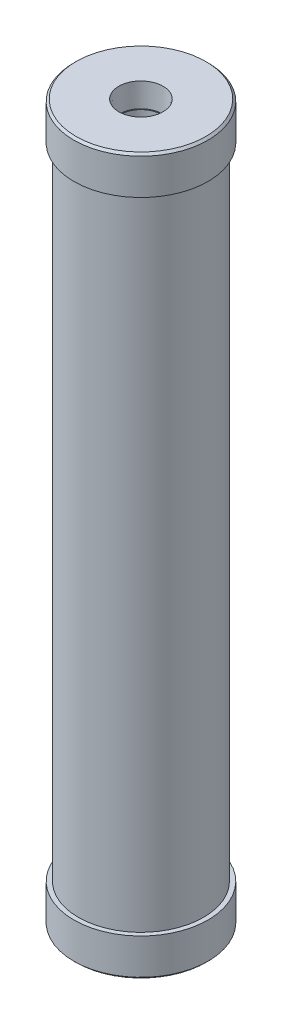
ISO-10303-21;
HEADER;
FILE_DESCRIPTION(('STEP AP214'),'2;1');
FILE_NAME('part.step','',(''),(''),'','','');
FILE_SCHEMA(('AUTOMOTIVE_DESIGN { 1 0 10303 214 1 1 1 1 }'));
ENDSEC;
DATA;
#1=APPLICATION_CONTEXT('core data for automotive mechanical design processes');
#2=APPLICATION_PROTOCOL_DEFINITION('international standard','automotive_design',2000,#1);
#3=PRODUCT_CONTEXT('',#1,'mechanical');
#4=PRODUCT('Part','Part','',(#3));
#5=PRODUCT_RELATED_PRODUCT_CATEGORY('part','',(#4));
#6=PRODUCT_DEFINITION_FORMATION('','',#4);
#7=PRODUCT_DEFINITION_CONTEXT('part definition',#1,'design');
#8=PRODUCT_DEFINITION('design','',#6,#7);
#9=PRODUCT_DEFINITION_SHAPE('','',#8);
#10=(LENGTH_UNIT() NAMED_UNIT(*) SI_UNIT(.MILLI.,.METRE.));
#11=(NAMED_UNIT(*) PLANE_ANGLE_UNIT() SI_UNIT($,.RADIAN.));
#12=(NAMED_UNIT(*) SI_UNIT($,.STERADIAN.) SOLID_ANGLE_UNIT());
#13=UNCERTAINTY_MEASURE_WITH_UNIT(LENGTH_MEASURE(1.E-05),#10,'distance_accuracy_value','');
#14=(GEOMETRIC_REPRESENTATION_CONTEXT(3) GLOBAL_UNCERTAINTY_ASSIGNED_CONTEXT((#13)) GLOBAL_UNIT_ASSIGNED_CONTEXT((#10,
#11,#12)) REPRESENTATION_CONTEXT('',''));
#15=CARTESIAN_POINT('',(0.,0.,0.));
#16=DIRECTION('',(0.,0.,1.));
#17=DIRECTION('',(1.,0.,0.));
#18=AXIS2_PLACEMENT_3D('',#15,#16,#17);
#19=CARTESIAN_POINT('',(0.,508.,0.));
#20=DIRECTION('',(0.,-1.,0.));
#21=DIRECTION('',(0.,0.,-1.));
#22=AXIS2_PLACEMENT_3D('',#19,#20,#21);
#23=CYLINDRICAL_SURFACE('',#22,44.45);
#24=CARTESIAN_POINT('',(0.,26.924,0.));
#25=DIRECTION('',(0.,1.,0.));
#26=DIRECTION('',(0.,0.,1.));
#27=AXIS2_PLACEMENT_3D('',#24,#25,#26);
#28=CIRCLE('',#27,44.45);
#29=CARTESIAN_POINT('',(0.,26.924,44.45));
#30=VERTEX_POINT('',#29);
#31=EDGE_CURVE('E71',#30,#30,#28,.T.);
#32=ORIENTED_EDGE('',*,*,#31,.T.);
#33=EDGE_LOOP('',(#32));
#34=FACE_BOUND('',#33,.T.);
#35=CARTESIAN_POINT('',(0.,481.076,0.));
#36=DIRECTION('',(0.,1.,0.));
#37=DIRECTION('',(0.,0.,1.));
#38=AXIS2_PLACEMENT_3D('',#35,#36,#37);
#39=CIRCLE('',#38,44.45);
#40=CARTESIAN_POINT('',(0.,481.076,44.45));
#41=VERTEX_POINT('',#40);
#42=EDGE_CURVE('E53',#41,#41,#39,.T.);
#43=ORIENTED_EDGE('',*,*,#42,.F.);
#44=EDGE_LOOP('',(#43));
#45=FACE_BOUND('',#44,.T.);
#46=ADVANCED_FACE('F33',(#34,#45),#23,.T.);
#47=CARTESIAN_POINT('',(0.,508.,0.));
#48=DIRECTION('',(0.,-1.,0.));
#49=DIRECTION('',(0.,0.,-1.));
#50=AXIS2_PLACEMENT_3D('',#47,#48,#49);
#51=CYLINDRICAL_SURFACE('',#50,38.6334);
#52=CARTESIAN_POINT('',(0.,26.924,0.));
#53=DIRECTION('',(0.,1.,0.));
#54=DIRECTION('',(0.,0.,1.));
#55=AXIS2_PLACEMENT_3D('',#52,#53,#54);
#56=CIRCLE('',#55,38.6334);
#57=CARTESIAN_POINT('',(0.,26.924,38.6334));
#58=VERTEX_POINT('',#57);
#59=EDGE_CURVE('E68',#58,#58,#56,.T.);
#60=ORIENTED_EDGE('',*,*,#59,.F.);
#61=EDGE_LOOP('',(#60));
#62=FACE_BOUND('',#61,.T.);
#63=CARTESIAN_POINT('',(0.,481.076,0.));
#64=DIRECTION('',(0.,1.,0.));
#65=DIRECTION('',(0.,0.,1.));
#66=AXIS2_PLACEMENT_3D('',#63,#64,#65);
#67=CIRCLE('',#66,38.6334);
#68=CARTESIAN_POINT('',(0.,481.076,38.6334));
#69=VERTEX_POINT('',#68);
#70=EDGE_CURVE('E59',#69,#69,#67,.T.);
#71=ORIENTED_EDGE('',*,*,#70,.T.);
#72=EDGE_LOOP('',(#71));
#73=FACE_BOUND('',#72,.T.);
#74=ADVANCED_FACE('F115',(#62,#73),#51,.F.);
#75=CARTESIAN_POINT('',(0.,26.924,0.));
#76=DIRECTION('',(0.,1.,0.));
#77=DIRECTION('',(0.,0.,1.));
#78=AXIS2_PLACEMENT_3D('',#75,#76,#77);
#79=PLANE('',#78);
#80=CARTESIAN_POINT('',(0.,26.924,0.));
#81=DIRECTION('',(0.,1.,0.));
#82=DIRECTION('',(0.,0.,1.));
#83=AXIS2_PLACEMENT_3D('',#80,#81,#82);
#84=CIRCLE('',#83,14.4907);
#85=CARTESIAN_POINT('',(0.,26.924,14.4907));
#86=VERTEX_POINT('',#85);
#87=EDGE_CURVE('E63',#86,#86,#84,.T.);
#88=ORIENTED_EDGE('',*,*,#87,.F.);
#89=EDGE_LOOP('',(#88));
#90=FACE_BOUND('',#89,.T.);
#91=ORIENTED_EDGE('',*,*,#59,.T.);
#92=EDGE_LOOP('',(#91));
#93=FACE_BOUND('',#92,.T.);
#94=ADVANCED_FACE('F121',(#90,#93),#79,.T.);
#95=CARTESIAN_POINT('',(0.,26.924,0.));
#96=DIRECTION('',(0.,1.,0.));
#97=DIRECTION('',(0.,0.,1.));
#98=AXIS2_PLACEMENT_3D('',#95,#96,#97);
#99=CIRCLE('',#98,47.625);
#100=CARTESIAN_POINT('',(0.,26.924,47.625));
#101=VERTEX_POINT('',#100);
#102=EDGE_CURVE('E66',#101,#101,#99,.T.);
#103=ORIENTED_EDGE('',*,*,#102,.T.);
#104=EDGE_LOOP('',(#103));
#105=FACE_BOUND('',#104,.T.);
#106=ORIENTED_EDGE('',*,*,#31,.F.);
#107=EDGE_LOOP('',(#106));
#108=FACE_BOUND('',#107,.T.);
#109=ADVANCED_FACE('F142',(#105,#108),#79,.T.);
#110=CARTESIAN_POINT('',(0.,26.924,0.));
#111=DIRECTION('',(0.,-1.,0.));
#112=DIRECTION('',(0.,0.,-1.));
#113=AXIS2_PLACEMENT_3D('',#110,#111,#112);
#114=CYLINDRICAL_SURFACE('',#113,47.625);
#115=CARTESIAN_POINT('',(0.,1.52400000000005,0.));
#116=DIRECTION('',(0.,1.,0.));
#117=DIRECTION('',(0.,0.,1.));
#118=AXIS2_PLACEMENT_3D('',#115,#116,#117);
#119=CIRCLE('',#118,47.625);
#120=CARTESIAN_POINT('',(0.,1.52400000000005,47.625));
#121=VERTEX_POINT('',#120);
#122=EDGE_CURVE('E48',#121,#121,#119,.T.);
#123=ORIENTED_EDGE('',*,*,#122,.T.);
#124=EDGE_LOOP('',(#123));
#125=FACE_BOUND('',#124,.T.);
#126=ORIENTED_EDGE('',*,*,#102,.F.);
#127=EDGE_LOOP('',(#126));
#128=FACE_BOUND('',#127,.T.);
#129=ADVANCED_FACE('F139',(#125,#128),#114,.T.);
#130=CARTESIAN_POINT('',(0.,0.,0.));
#131=DIRECTION('',(0.,1.,0.));
#132=DIRECTION('',(0.,0.,1.));
#133=AXIS2_PLACEMENT_3D('',#130,#131,#132);
#134=PLANE('',#133);
#135=CARTESIAN_POINT('',(0.,0.,0.));
#136=DIRECTION('',(0.,1.,0.));
#137=DIRECTION('',(0.,0.,1.));
#138=AXIS2_PLACEMENT_3D('',#135,#136,#137);
#139=CIRCLE('',#138,46.1009999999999);
#140=CARTESIAN_POINT('',(0.,0.,46.1009999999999));
#141=VERTEX_POINT('',#140);
#142=EDGE_CURVE('E44',#141,#141,#139,.F.);
#143=ORIENTED_EDGE('',*,*,#142,.T.);
#144=EDGE_LOOP('',(#143));
#145=FACE_BOUND('',#144,.T.);
#146=CARTESIAN_POINT('',(0.,0.,0.));
#147=DIRECTION('',(0.,-1.,0.));
#148=DIRECTION('',(0.,0.,-1.));
#149=AXIS2_PLACEMENT_3D('',#146,#147,#148);
#150=CIRCLE('',#149,15.7299152);
#151=CARTESIAN_POINT('',(0.,0.,-15.7299152));
#152=VERTEX_POINT('',#151);
#153=EDGE_CURVE('E62',#152,#152,#150,.T.);
#154=ORIENTED_EDGE('',*,*,#153,.F.);
#155=EDGE_LOOP('',(#154));
#156=FACE_BOUND('',#155,.T.);
#157=ADVANCED_FACE('F124',(#145,#156),#134,.F.);
#158=CARTESIAN_POINT('',(0.,0.,0.));
#159=DIRECTION('',(0.,-1.,0.));
#160=DIRECTION('',(0.,0.,-1.));
#161=AXIS2_PLACEMENT_3D('',#158,#159,#160);
#162=CYLINDRICAL_SURFACE('',#161,14.4907);
#163=ORIENTED_EDGE('',*,*,#87,.T.);
#164=EDGE_LOOP('',(#163));
#165=FACE_BOUND('',#164,.T.);
#166=CARTESIAN_POINT('',(0.,16.764,0.));
#167=DIRECTION('',(0.,-1.,0.));
#168=DIRECTION('',(0.,0.,-1.));
#169=AXIS2_PLACEMENT_3D('',#166,#167,#168);
#170=CIRCLE('',#169,14.4907);
#171=CARTESIAN_POINT('',(0.,16.764,-14.4907));
#172=VERTEX_POINT('',#171);
#173=EDGE_CURVE('E67',#172,#172,#170,.T.);
#174=ORIENTED_EDGE('',*,*,#173,.T.);
#175=EDGE_LOOP('',(#174));
#176=FACE_BOUND('',#175,.T.);
#177=ADVANCED_FACE('F155',(#165,#176),#162,.F.);
#178=CARTESIAN_POINT('',(14.4907,16.764,0.));
#179=DIRECTION('',(0.,1.,0.));
#180=DIRECTION('',(0.,0.,1.));
#181=AXIS2_PLACEMENT_3D('',#178,#179,#180);
#182=PLANE('',#181);
#183=ORIENTED_EDGE('',*,*,#173,.F.);
#184=EDGE_LOOP('',(#183));
#185=FACE_BOUND('',#184,.T.);
#186=CARTESIAN_POINT('',(0.,16.764,0.));
#187=DIRECTION('',(0.,-1.,0.));
#188=DIRECTION('',(0.,0.,-1.));
#189=AXIS2_PLACEMENT_3D('',#186,#187,#188);
#190=CIRCLE('',#189,15.2279785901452);
#191=CARTESIAN_POINT('',(0.,16.764,-15.2279785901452));
#192=VERTEX_POINT('',#191);
#193=EDGE_CURVE('E78',#192,#192,#190,.T.);
#194=ORIENTED_EDGE('',*,*,#193,.T.);
#195=EDGE_LOOP('',(#194));
#196=FACE_BOUND('',#195,.T.);
#197=ADVANCED_FACE('F158',(#185,#196),#182,.F.);
#198=CARTESIAN_POINT('',(0.,0.,0.));
#199=DIRECTION('',(0.,-1.,0.));
#200=DIRECTION('',(0.,0.,-1.));
#201=AXIS2_PLACEMENT_3D('',#198,#199,#200);
#202=CONICAL_SURFACE('',#201,15.7299152,0.0299323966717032);
#203=ORIENTED_EDGE('',*,*,#193,.F.);
#204=EDGE_LOOP('',(#203));
#205=FACE_BOUND('',#204,.T.);
#206=ORIENTED_EDGE('',*,*,#153,.T.);
#207=EDGE_LOOP('',(#206));
#208=FACE_BOUND('',#207,.T.);
#209=ADVANCED_FACE('F162',(#205,#208),#202,.F.);
#210=CARTESIAN_POINT('',(0.,481.076,0.));
#211=DIRECTION('',(0.,1.,0.));
#212=DIRECTION('',(0.,0.,1.));
#213=AXIS2_PLACEMENT_3D('',#210,#211,#212);
#214=PLANE('',#213);
#215=CARTESIAN_POINT('',(0.,481.076,0.));
#216=DIRECTION('',(0.,1.,0.));
#217=DIRECTION('',(0.,0.,1.));
#218=AXIS2_PLACEMENT_3D('',#215,#216,#217);
#219=CIRCLE('',#218,14.4907);
#220=CARTESIAN_POINT('',(0.,481.076,14.4907));
#221=VERTEX_POINT('',#220);
#222=EDGE_CURVE('E54',#221,#221,#219,.T.);
#223=ORIENTED_EDGE('',*,*,#222,.T.);
#224=EDGE_LOOP('',(#223));
#225=FACE_BOUND('',#224,.T.);
#226=ORIENTED_EDGE('',*,*,#70,.F.);
#227=EDGE_LOOP('',(#226));
#228=FACE_BOUND('',#227,.T.);
#229=ADVANCED_FACE('F165',(#225,#228),#214,.F.);
#230=CARTESIAN_POINT('',(0.,481.076,0.));
#231=DIRECTION('',(0.,1.,0.));
#232=DIRECTION('',(0.,0.,1.));
#233=AXIS2_PLACEMENT_3D('',#230,#231,#232);
#234=CIRCLE('',#233,47.625);
#235=CARTESIAN_POINT('',(0.,481.076,47.625));
#236=VERTEX_POINT('',#235);
#237=EDGE_CURVE('E57',#236,#236,#234,.T.);
#238=ORIENTED_EDGE('',*,*,#237,.F.);
#239=EDGE_LOOP('',(#238));
#240=FACE_BOUND('',#239,.T.);
#241=ORIENTED_EDGE('',*,*,#42,.T.);
#242=EDGE_LOOP('',(#241));
#243=FACE_BOUND('',#242,.T.);
#244=ADVANCED_FACE('F110',(#240,#243),#214,.F.);
#245=CARTESIAN_POINT('',(0.,481.076,0.));
#246=DIRECTION('',(0.,1.,0.));
#247=DIRECTION('',(0.,0.,1.));
#248=AXIS2_PLACEMENT_3D('',#245,#246,#247);
#249=CYLINDRICAL_SURFACE('',#248,47.625);
#250=CARTESIAN_POINT('',(0.,506.476,0.));
#251=DIRECTION('',(0.,1.,0.));
#252=DIRECTION('',(0.,0.,1.));
#253=AXIS2_PLACEMENT_3D('',#250,#251,#252);
#254=CIRCLE('',#253,47.625);
#255=CARTESIAN_POINT('',(0.,506.476,47.625));
#256=VERTEX_POINT('',#255);
#257=EDGE_CURVE('E10',#256,#256,#254,.F.);
#258=ORIENTED_EDGE('',*,*,#257,.T.);
#259=EDGE_LOOP('',(#258));
#260=FACE_BOUND('',#259,.T.);
#261=ORIENTED_EDGE('',*,*,#237,.T.);
#262=EDGE_LOOP('',(#261));
#263=FACE_BOUND('',#262,.T.);
#264=ADVANCED_FACE('F101',(#260,#263),#249,.T.);
#265=CARTESIAN_POINT('',(0.,508.,0.));
#266=DIRECTION('',(0.,1.,0.));
#267=DIRECTION('',(0.,0.,1.));
#268=AXIS2_PLACEMENT_3D('',#265,#266,#267);
#269=PLANE('',#268);
#270=CARTESIAN_POINT('',(0.,508.,0.));
#271=DIRECTION('',(0.,1.,0.));
#272=DIRECTION('',(0.,0.,1.));
#273=AXIS2_PLACEMENT_3D('',#270,#271,#272);
#274=CIRCLE('',#273,46.1010000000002);
#275=CARTESIAN_POINT('',(0.,508.,46.1010000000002));
#276=VERTEX_POINT('',#275);
#277=EDGE_CURVE('E40',#276,#276,#274,.T.);
#278=ORIENTED_EDGE('',*,*,#277,.T.);
#279=EDGE_LOOP('',(#278));
#280=FACE_BOUND('',#279,.T.);
#281=CARTESIAN_POINT('',(0.,508.,0.));
#282=DIRECTION('',(0.,1.,0.));
#283=DIRECTION('',(0.,0.,1.));
#284=AXIS2_PLACEMENT_3D('',#281,#282,#283);
#285=CIRCLE('',#284,15.7299152);
#286=CARTESIAN_POINT('',(0.,508.,15.7299152));
#287=VERTEX_POINT('',#286);
#288=EDGE_CURVE('E92',#287,#287,#285,.T.);
#289=ORIENTED_EDGE('',*,*,#288,.F.);
#290=EDGE_LOOP('',(#289));
#291=FACE_BOUND('',#290,.T.);
#292=ADVANCED_FACE('F98',(#280,#291),#269,.T.);
#293=CARTESIAN_POINT('',(0.,508.,0.));
#294=DIRECTION('',(0.,1.,0.));
#295=DIRECTION('',(0.,0.,1.));
#296=AXIS2_PLACEMENT_3D('',#293,#294,#295);
#297=CYLINDRICAL_SURFACE('',#296,14.4907);
#298=CARTESIAN_POINT('',(0.,491.236,0.));
#299=DIRECTION('',(0.,1.,0.));
#300=DIRECTION('',(0.,0.,1.));
#301=AXIS2_PLACEMENT_3D('',#298,#299,#300);
#302=CIRCLE('',#301,14.4907);
#303=CARTESIAN_POINT('',(0.,491.236,14.4907));
#304=VERTEX_POINT('',#303);
#305=EDGE_CURVE('E58',#304,#304,#302,.T.);
#306=ORIENTED_EDGE('',*,*,#305,.T.);
#307=EDGE_LOOP('',(#306));
#308=FACE_BOUND('',#307,.T.);
#309=ORIENTED_EDGE('',*,*,#222,.F.);
#310=EDGE_LOOP('',(#309));
#311=FACE_BOUND('',#310,.T.);
#312=ADVANCED_FACE('F100',(#308,#311),#297,.F.);
#313=CARTESIAN_POINT('',(14.4907,491.236,0.));
#314=DIRECTION('',(0.,-1.,0.));
#315=DIRECTION('',(0.,0.,-1.));
#316=AXIS2_PLACEMENT_3D('',#313,#314,#315);
#317=PLANE('',#316);
#318=ORIENTED_EDGE('',*,*,#305,.F.);
#319=EDGE_LOOP('',(#318));
#320=FACE_BOUND('',#319,.T.);
#321=CARTESIAN_POINT('',(0.,491.236,0.));
#322=DIRECTION('',(0.,1.,0.));
#323=DIRECTION('',(0.,0.,1.));
#324=AXIS2_PLACEMENT_3D('',#321,#322,#323);
#325=CIRCLE('',#324,15.2279785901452);
#326=CARTESIAN_POINT('',(0.,491.236,15.2279785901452));
#327=VERTEX_POINT('',#326);
#328=EDGE_CURVE('E89',#327,#327,#325,.T.);
#329=ORIENTED_EDGE('',*,*,#328,.T.);
#330=EDGE_LOOP('',(#329));
#331=FACE_BOUND('',#330,.T.);
#332=ADVANCED_FACE('F107',(#320,#331),#317,.F.);
#333=CARTESIAN_POINT('',(0.,508.,0.));
#334=DIRECTION('',(0.,1.,0.));
#335=DIRECTION('',(0.,0.,1.));
#336=AXIS2_PLACEMENT_3D('',#333,#334,#335);
#337=CONICAL_SURFACE('',#336,15.7299152,0.0299323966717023);
#338=ORIENTED_EDGE('',*,*,#328,.F.);
#339=EDGE_LOOP('',(#338));
#340=FACE_BOUND('',#339,.T.);
#341=ORIENTED_EDGE('',*,*,#288,.T.);
#342=EDGE_LOOP('',(#341));
#343=FACE_BOUND('',#342,.T.);
#344=ADVANCED_FACE('F96',(#340,#343),#337,.F.);
#345=CARTESIAN_POINT('',(0.,1.52400000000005,0.));
#346=DIRECTION('',(0.,1.,0.));
#347=DIRECTION('',(0.,0.,1.));
#348=AXIS2_PLACEMENT_3D('',#345,#346,#347);
#349=CONICAL_SURFACE('',#348,47.625,0.785398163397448);
#350=ORIENTED_EDGE('',*,*,#142,.F.);
#351=EDGE_LOOP('',(#350));
#352=FACE_BOUND('',#351,.T.);
#353=ORIENTED_EDGE('',*,*,#122,.F.);
#354=EDGE_LOOP('',(#353));
#355=FACE_BOUND('',#354,.T.);
#356=ADVANCED_FACE('F125',(#352,#355),#349,.T.);
#357=CARTESIAN_POINT('',(0.,508.,0.));
#358=DIRECTION('',(0.,-1.,0.));
#359=DIRECTION('',(0.,0.,-1.));
#360=AXIS2_PLACEMENT_3D('',#357,#358,#359);
#361=CONICAL_SURFACE('',#360,46.1010000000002,0.785398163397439);
#362=ORIENTED_EDGE('',*,*,#257,.F.);
#363=EDGE_LOOP('',(#362));
#364=FACE_BOUND('',#363,.T.);
#365=ORIENTED_EDGE('',*,*,#277,.F.);
#366=EDGE_LOOP('',(#365));
#367=FACE_BOUND('',#366,.T.);
#368=ADVANCED_FACE('F35',(#364,#367),#361,.T.);
#369=CLOSED_SHELL('',(#46,#74,#94,#109,#129,#157,#177,#197,#209,#229,#244,#264,#292,#312,#332,
#344,#356,#368));
#370=MANIFOLD_SOLID_BREP('B2',#369);
#371=ADVANCED_BREP_SHAPE_REPRESENTATION('',(#18,#370),#14);
#372=SHAPE_DEFINITION_REPRESENTATION(#9,#371);
ENDSEC;
END-ISO-10303-21;
